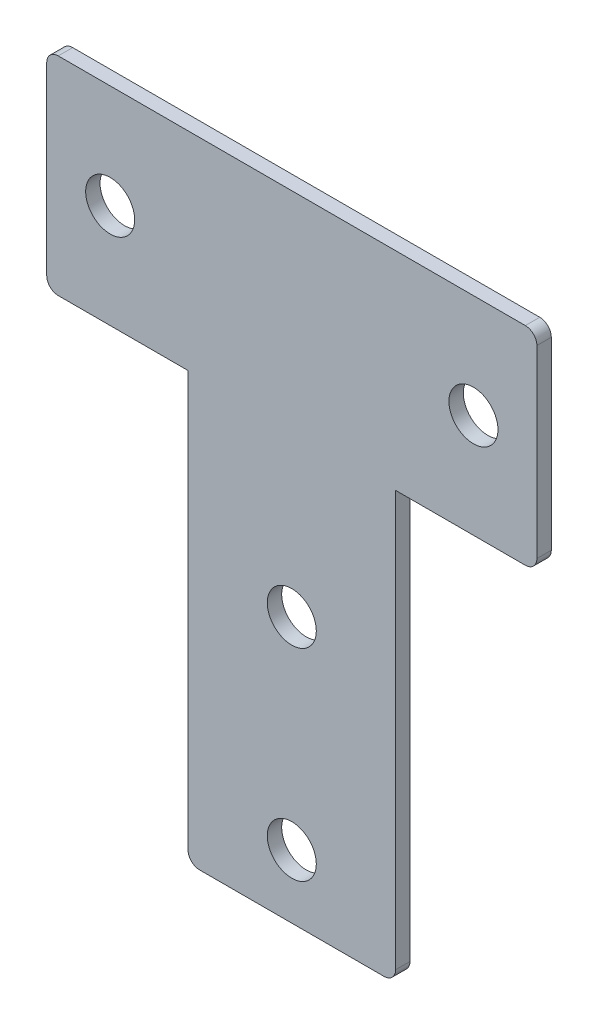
ISO-10303-21;
HEADER;
FILE_DESCRIPTION(('STEP AP214'),'2;1');
FILE_NAME('part.step','',(''),(''),'','','');
FILE_SCHEMA(('AUTOMOTIVE_DESIGN { 1 0 10303 214 1 1 1 1 }'));
ENDSEC;
DATA;
#1=APPLICATION_CONTEXT('core data for automotive mechanical design processes');
#2=APPLICATION_PROTOCOL_DEFINITION('international standard','automotive_design',2000,#1);
#3=PRODUCT_CONTEXT('',#1,'mechanical');
#4=PRODUCT('Part','Part','',(#3));
#5=PRODUCT_RELATED_PRODUCT_CATEGORY('part','',(#4));
#6=PRODUCT_DEFINITION_FORMATION('','',#4);
#7=PRODUCT_DEFINITION_CONTEXT('part definition',#1,'design');
#8=PRODUCT_DEFINITION('design','',#6,#7);
#9=PRODUCT_DEFINITION_SHAPE('','',#8);
#10=(LENGTH_UNIT() NAMED_UNIT(*) SI_UNIT(.MILLI.,.METRE.));
#11=(NAMED_UNIT(*) PLANE_ANGLE_UNIT() SI_UNIT($,.RADIAN.));
#12=(NAMED_UNIT(*) SI_UNIT($,.STERADIAN.) SOLID_ANGLE_UNIT());
#13=UNCERTAINTY_MEASURE_WITH_UNIT(LENGTH_MEASURE(1.E-05),#10,'distance_accuracy_value','');
#14=(GEOMETRIC_REPRESENTATION_CONTEXT(3) GLOBAL_UNCERTAINTY_ASSIGNED_CONTEXT((#13)) GLOBAL_UNIT_ASSIGNED_CONTEXT((#10,
#11,#12)) REPRESENTATION_CONTEXT('',''));
#15=CARTESIAN_POINT('',(0.,0.,0.));
#16=DIRECTION('',(0.,0.,1.));
#17=DIRECTION('',(1.,0.,0.));
#18=AXIS2_PLACEMENT_3D('',#15,#16,#17);
#19=CARTESIAN_POINT('',(0.,0.,1.25));
#20=DIRECTION('',(0.,0.,1.));
#21=DIRECTION('',(1.,0.,0.));
#22=AXIS2_PLACEMENT_3D('',#19,#20,#21);
#23=PLANE('',#22);
#24=DIRECTION('',(1.,0.,0.));
#25=VECTOR('',#24,1.);
#26=CARTESIAN_POINT('',(-18.,-92.,1.25));
#27=LINE('',#26,#25);
#28=CARTESIAN_POINT('',(-16.,-92.,1.25));
#29=VERTEX_POINT('',#28);
#30=CARTESIAN_POINT('',(16.,-92.,1.25));
#31=VERTEX_POINT('',#30);
#32=EDGE_CURVE('E163',#29,#31,#27,.T.);
#33=ORIENTED_EDGE('',*,*,#32,.T.);
#34=CARTESIAN_POINT('',(16.,-90.,1.25));
#35=DIRECTION('',(0.,0.,1.));
#36=DIRECTION('',(1.,0.,0.));
#37=AXIS2_PLACEMENT_3D('',#34,#35,#36);
#38=CIRCLE('',#37,2.);
#39=CARTESIAN_POINT('',(18.,-90.,1.25));
#40=VERTEX_POINT('',#39);
#41=EDGE_CURVE('E223',#31,#40,#38,.T.);
#42=ORIENTED_EDGE('',*,*,#41,.T.);
#43=DIRECTION('',(0.,1.,0.));
#44=VECTOR('',#43,1.);
#45=CARTESIAN_POINT('',(18.,-18.,1.25));
#46=LINE('',#45,#44);
#47=CARTESIAN_POINT('',(18.,-18.,1.25));
#48=VERTEX_POINT('',#47);
#49=EDGE_CURVE('E165',#40,#48,#46,.T.);
#50=ORIENTED_EDGE('',*,*,#49,.T.);
#51=DIRECTION('',(1.,0.,0.));
#52=VECTOR('',#51,1.);
#53=CARTESIAN_POINT('',(18.,-18.,1.25));
#54=LINE('',#53,#52);
#55=CARTESIAN_POINT('',(40.5,-18.,1.25));
#56=VERTEX_POINT('',#55);
#57=EDGE_CURVE('E170',#48,#56,#54,.T.);
#58=ORIENTED_EDGE('',*,*,#57,.T.);
#59=CARTESIAN_POINT('',(40.5,-16.,1.25));
#60=DIRECTION('',(0.,0.,1.));
#61=DIRECTION('',(1.,0.,0.));
#62=AXIS2_PLACEMENT_3D('',#59,#60,#61);
#63=CIRCLE('',#62,2.);
#64=CARTESIAN_POINT('',(42.5,-16.,1.25));
#65=VERTEX_POINT('',#64);
#66=EDGE_CURVE('E216',#56,#65,#63,.T.);
#67=ORIENTED_EDGE('',*,*,#66,.T.);
#68=DIRECTION('',(0.,1.,0.));
#69=VECTOR('',#68,1.);
#70=CARTESIAN_POINT('',(42.5,18.,1.25));
#71=LINE('',#70,#69);
#72=CARTESIAN_POINT('',(42.5,16.,1.25));
#73=VERTEX_POINT('',#72);
#74=EDGE_CURVE('E192',#65,#73,#71,.T.);
#75=ORIENTED_EDGE('',*,*,#74,.T.);
#76=CARTESIAN_POINT('',(40.5,16.,1.25));
#77=DIRECTION('',(0.,0.,1.));
#78=DIRECTION('',(1.,0.,0.));
#79=AXIS2_PLACEMENT_3D('',#76,#77,#78);
#80=CIRCLE('',#79,2.);
#81=CARTESIAN_POINT('',(40.5,18.,1.25));
#82=VERTEX_POINT('',#81);
#83=EDGE_CURVE('E214',#73,#82,#80,.T.);
#84=ORIENTED_EDGE('',*,*,#83,.T.);
#85=DIRECTION('',(-1.,0.,0.));
#86=VECTOR('',#85,1.);
#87=CARTESIAN_POINT('',(-42.5,18.,1.25));
#88=LINE('',#87,#86);
#89=CARTESIAN_POINT('',(-40.5,18.,1.25));
#90=VERTEX_POINT('',#89);
#91=EDGE_CURVE('E263',#82,#90,#88,.T.);
#92=ORIENTED_EDGE('',*,*,#91,.T.);
#93=CARTESIAN_POINT('',(-40.5,16.,1.25));
#94=DIRECTION('',(0.,0.,1.));
#95=DIRECTION('',(1.,0.,0.));
#96=AXIS2_PLACEMENT_3D('',#93,#94,#95);
#97=CIRCLE('',#96,2.);
#98=CARTESIAN_POINT('',(-42.5,16.,1.25));
#99=VERTEX_POINT('',#98);
#100=EDGE_CURVE('E218',#90,#99,#97,.T.);
#101=ORIENTED_EDGE('',*,*,#100,.T.);
#102=DIRECTION('',(0.,-1.,0.));
#103=VECTOR('',#102,1.);
#104=CARTESIAN_POINT('',(-42.5,18.,1.25));
#105=LINE('',#104,#103);
#106=CARTESIAN_POINT('',(-42.5,-16.,1.25));
#107=VERTEX_POINT('',#106);
#108=EDGE_CURVE('E151',#99,#107,#105,.T.);
#109=ORIENTED_EDGE('',*,*,#108,.T.);
#110=CARTESIAN_POINT('',(-40.5,-16.,1.25));
#111=DIRECTION('',(0.,0.,1.));
#112=DIRECTION('',(1.,0.,0.));
#113=AXIS2_PLACEMENT_3D('',#110,#111,#112);
#114=CIRCLE('',#113,2.);
#115=CARTESIAN_POINT('',(-40.5,-18.,1.25));
#116=VERTEX_POINT('',#115);
#117=EDGE_CURVE('E147',#107,#116,#114,.T.);
#118=ORIENTED_EDGE('',*,*,#117,.T.);
#119=DIRECTION('',(1.,0.,0.));
#120=VECTOR('',#119,1.);
#121=CARTESIAN_POINT('',(-42.5,-18.,1.25));
#122=LINE('',#121,#120);
#123=CARTESIAN_POINT('',(-18.,-18.,1.25));
#124=VERTEX_POINT('',#123);
#125=EDGE_CURVE('E139',#116,#124,#122,.T.);
#126=ORIENTED_EDGE('',*,*,#125,.T.);
#127=DIRECTION('',(0.,-1.,0.));
#128=VECTOR('',#127,1.);
#129=CARTESIAN_POINT('',(-18.,-18.,1.25));
#130=LINE('',#129,#128);
#131=CARTESIAN_POINT('',(-18.,-90.,1.25));
#132=VERTEX_POINT('',#131);
#133=EDGE_CURVE('E143',#124,#132,#130,.T.);
#134=ORIENTED_EDGE('',*,*,#133,.T.);
#135=CARTESIAN_POINT('',(-16.,-90.,1.25));
#136=DIRECTION('',(0.,0.,1.));
#137=DIRECTION('',(1.,0.,0.));
#138=AXIS2_PLACEMENT_3D('',#135,#136,#137);
#139=CIRCLE('',#138,2.);
#140=EDGE_CURVE('E221',#132,#29,#139,.T.);
#141=ORIENTED_EDGE('',*,*,#140,.T.);
#142=EDGE_LOOP('',(#33,#42,#50,#58,#67,#75,#84,#92,#101,#109,#118,#126,#134,#141));
#143=FACE_BOUND('',#142,.T.);
#144=CARTESIAN_POINT('',(31.5,0.,1.25));
#145=DIRECTION('',(0.,0.,1.));
#146=DIRECTION('',(1.,0.,0.));
#147=AXIS2_PLACEMENT_3D('',#144,#145,#146);
#148=CIRCLE('',#147,4.25000000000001);
#149=CARTESIAN_POINT('',(35.75,0.,1.25));
#150=VERTEX_POINT('',#149);
#151=EDGE_CURVE('E268',#150,#150,#148,.T.);
#152=ORIENTED_EDGE('',*,*,#151,.F.);
#153=EDGE_LOOP('',(#152));
#154=FACE_BOUND('',#153,.T.);
#155=CARTESIAN_POINT('',(0.,-81.,1.25));
#156=DIRECTION('',(0.,0.,1.));
#157=DIRECTION('',(1.,0.,0.));
#158=AXIS2_PLACEMENT_3D('',#155,#156,#157);
#159=CIRCLE('',#158,4.25);
#160=CARTESIAN_POINT('',(4.24999999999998,-81.,1.25));
#161=VERTEX_POINT('',#160);
#162=EDGE_CURVE('E274',#161,#161,#159,.T.);
#163=ORIENTED_EDGE('',*,*,#162,.F.);
#164=EDGE_LOOP('',(#163));
#165=FACE_BOUND('',#164,.T.);
#166=CARTESIAN_POINT('',(0.,-46.,1.25));
#167=DIRECTION('',(0.,0.,1.));
#168=DIRECTION('',(1.,0.,0.));
#169=AXIS2_PLACEMENT_3D('',#166,#167,#168);
#170=CIRCLE('',#169,4.25);
#171=CARTESIAN_POINT('',(4.24999999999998,-46.,1.25));
#172=VERTEX_POINT('',#171);
#173=EDGE_CURVE('E280',#172,#172,#170,.T.);
#174=ORIENTED_EDGE('',*,*,#173,.F.);
#175=EDGE_LOOP('',(#174));
#176=FACE_BOUND('',#175,.T.);
#177=CARTESIAN_POINT('',(-31.5,0.,1.25));
#178=DIRECTION('',(0.,0.,-1.));
#179=DIRECTION('',(-1.,0.,0.));
#180=AXIS2_PLACEMENT_3D('',#177,#178,#179);
#181=CIRCLE('',#180,4.25000000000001);
#182=CARTESIAN_POINT('',(-35.75,0.,1.25));
#183=VERTEX_POINT('',#182);
#184=EDGE_CURVE('E286',#183,#183,#181,.T.);
#185=ORIENTED_EDGE('',*,*,#184,.T.);
#186=EDGE_LOOP('',(#185));
#187=FACE_BOUND('',#186,.T.);
#188=ADVANCED_FACE('F37',(#143,#154,#165,#176,#187),#23,.T.);
#189=CARTESIAN_POINT('',(0.,0.,-1.25));
#190=DIRECTION('',(0.,0.,1.));
#191=DIRECTION('',(1.,0.,0.));
#192=AXIS2_PLACEMENT_3D('',#189,#190,#191);
#193=PLANE('',#192);
#194=DIRECTION('',(0.,1.,0.));
#195=VECTOR('',#194,1.);
#196=CARTESIAN_POINT('',(18.,-18.,-1.25));
#197=LINE('',#196,#195);
#198=CARTESIAN_POINT('',(18.,-90.,-1.25));
#199=VERTEX_POINT('',#198);
#200=CARTESIAN_POINT('',(18.,-18.,-1.25));
#201=VERTEX_POINT('',#200);
#202=EDGE_CURVE('E188',#199,#201,#197,.T.);
#203=ORIENTED_EDGE('',*,*,#202,.F.);
#204=CARTESIAN_POINT('',(16.,-90.,-1.25));
#205=DIRECTION('',(0.,0.,1.));
#206=DIRECTION('',(1.,0.,0.));
#207=AXIS2_PLACEMENT_3D('',#204,#205,#206);
#208=CIRCLE('',#207,2.);
#209=CARTESIAN_POINT('',(16.,-92.,-1.25));
#210=VERTEX_POINT('',#209);
#211=EDGE_CURVE('E207',#199,#210,#208,.F.);
#212=ORIENTED_EDGE('',*,*,#211,.T.);
#213=DIRECTION('',(1.,0.,0.));
#214=VECTOR('',#213,1.);
#215=CARTESIAN_POINT('',(-18.,-92.,-1.25));
#216=LINE('',#215,#214);
#217=CARTESIAN_POINT('',(-16.,-92.,-1.25));
#218=VERTEX_POINT('',#217);
#219=EDGE_CURVE('E185',#218,#210,#216,.T.);
#220=ORIENTED_EDGE('',*,*,#219,.F.);
#221=CARTESIAN_POINT('',(-16.,-90.,-1.25));
#222=DIRECTION('',(0.,0.,1.));
#223=DIRECTION('',(1.,0.,0.));
#224=AXIS2_PLACEMENT_3D('',#221,#222,#223);
#225=CIRCLE('',#224,2.);
#226=CARTESIAN_POINT('',(-18.,-90.,-1.25));
#227=VERTEX_POINT('',#226);
#228=EDGE_CURVE('E205',#218,#227,#225,.F.);
#229=ORIENTED_EDGE('',*,*,#228,.T.);
#230=DIRECTION('',(0.,-1.,0.));
#231=VECTOR('',#230,1.);
#232=CARTESIAN_POINT('',(-18.,-18.,-1.25));
#233=LINE('',#232,#231);
#234=CARTESIAN_POINT('',(-18.,-18.,-1.25));
#235=VERTEX_POINT('',#234);
#236=EDGE_CURVE('E183',#235,#227,#233,.T.);
#237=ORIENTED_EDGE('',*,*,#236,.F.);
#238=DIRECTION('',(1.,0.,0.));
#239=VECTOR('',#238,1.);
#240=CARTESIAN_POINT('',(-42.5,-18.,-1.25));
#241=LINE('',#240,#239);
#242=CARTESIAN_POINT('',(-40.5,-18.,-1.25));
#243=VERTEX_POINT('',#242);
#244=EDGE_CURVE('E157',#243,#235,#241,.T.);
#245=ORIENTED_EDGE('',*,*,#244,.F.);
#246=CARTESIAN_POINT('',(-40.5,-16.,-1.25));
#247=DIRECTION('',(0.,0.,1.));
#248=DIRECTION('',(1.,0.,0.));
#249=AXIS2_PLACEMENT_3D('',#246,#247,#248);
#250=CIRCLE('',#249,2.);
#251=CARTESIAN_POINT('',(-42.5,-16.,-1.25));
#252=VERTEX_POINT('',#251);
#253=EDGE_CURVE('E203',#243,#252,#250,.F.);
#254=ORIENTED_EDGE('',*,*,#253,.T.);
#255=DIRECTION('',(0.,-1.,0.));
#256=VECTOR('',#255,1.);
#257=CARTESIAN_POINT('',(-42.5,18.,-1.25));
#258=LINE('',#257,#256);
#259=CARTESIAN_POINT('',(-42.5,16.,-1.25));
#260=VERTEX_POINT('',#259);
#261=EDGE_CURVE('E179',#260,#252,#258,.T.);
#262=ORIENTED_EDGE('',*,*,#261,.F.);
#263=CARTESIAN_POINT('',(-40.5,16.,-1.25));
#264=DIRECTION('',(0.,0.,1.));
#265=DIRECTION('',(1.,0.,0.));
#266=AXIS2_PLACEMENT_3D('',#263,#264,#265);
#267=CIRCLE('',#266,2.);
#268=CARTESIAN_POINT('',(-40.5,18.,-1.25));
#269=VERTEX_POINT('',#268);
#270=EDGE_CURVE('E201',#260,#269,#267,.F.);
#271=ORIENTED_EDGE('',*,*,#270,.T.);
#272=DIRECTION('',(-1.,0.,0.));
#273=VECTOR('',#272,1.);
#274=CARTESIAN_POINT('',(-42.5,18.,-1.25));
#275=LINE('',#274,#273);
#276=CARTESIAN_POINT('',(40.5,18.,-1.25));
#277=VERTEX_POINT('',#276);
#278=EDGE_CURVE('E175',#277,#269,#275,.T.);
#279=ORIENTED_EDGE('',*,*,#278,.F.);
#280=CARTESIAN_POINT('',(40.5,16.,-1.25));
#281=DIRECTION('',(0.,0.,1.));
#282=DIRECTION('',(1.,0.,0.));
#283=AXIS2_PLACEMENT_3D('',#280,#281,#282);
#284=CIRCLE('',#283,2.);
#285=CARTESIAN_POINT('',(42.5,16.,-1.25));
#286=VERTEX_POINT('',#285);
#287=EDGE_CURVE('E197',#277,#286,#284,.F.);
#288=ORIENTED_EDGE('',*,*,#287,.T.);
#289=DIRECTION('',(0.,1.,0.));
#290=VECTOR('',#289,1.);
#291=CARTESIAN_POINT('',(42.5,18.,-1.25));
#292=LINE('',#291,#290);
#293=CARTESIAN_POINT('',(42.5,-16.,-1.25));
#294=VERTEX_POINT('',#293);
#295=EDGE_CURVE('E172',#294,#286,#292,.T.);
#296=ORIENTED_EDGE('',*,*,#295,.F.);
#297=CARTESIAN_POINT('',(40.5,-16.,-1.25));
#298=DIRECTION('',(0.,0.,1.));
#299=DIRECTION('',(1.,0.,0.));
#300=AXIS2_PLACEMENT_3D('',#297,#298,#299);
#301=CIRCLE('',#300,2.);
#302=CARTESIAN_POINT('',(40.5,-18.,-1.25));
#303=VERTEX_POINT('',#302);
#304=EDGE_CURVE('E199',#294,#303,#301,.F.);
#305=ORIENTED_EDGE('',*,*,#304,.T.);
#306=DIRECTION('',(1.,0.,0.));
#307=VECTOR('',#306,1.);
#308=CARTESIAN_POINT('',(18.,-18.,-1.25));
#309=LINE('',#308,#307);
#310=EDGE_CURVE('E190',#201,#303,#309,.T.);
#311=ORIENTED_EDGE('',*,*,#310,.F.);
#312=EDGE_LOOP('',(#203,#212,#220,#229,#237,#245,#254,#262,#271,#279,#288,#296,#305,#311));
#313=FACE_BOUND('',#312,.T.);
#314=CARTESIAN_POINT('',(31.5,0.,-1.25));
#315=DIRECTION('',(0.,0.,1.));
#316=DIRECTION('',(1.,0.,0.));
#317=AXIS2_PLACEMENT_3D('',#314,#315,#316);
#318=CIRCLE('',#317,4.25000000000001);
#319=CARTESIAN_POINT('',(35.75,0.,-1.25));
#320=VERTEX_POINT('',#319);
#321=EDGE_CURVE('E176',#320,#320,#318,.T.);
#322=ORIENTED_EDGE('',*,*,#321,.T.);
#323=EDGE_LOOP('',(#322));
#324=FACE_BOUND('',#323,.T.);
#325=CARTESIAN_POINT('',(0.,-81.,-1.25));
#326=DIRECTION('',(0.,0.,1.));
#327=DIRECTION('',(1.,0.,0.));
#328=AXIS2_PLACEMENT_3D('',#325,#326,#327);
#329=CIRCLE('',#328,4.25);
#330=CARTESIAN_POINT('',(4.24999999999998,-81.,-1.25));
#331=VERTEX_POINT('',#330);
#332=EDGE_CURVE('E271',#331,#331,#329,.T.);
#333=ORIENTED_EDGE('',*,*,#332,.T.);
#334=EDGE_LOOP('',(#333));
#335=FACE_BOUND('',#334,.T.);
#336=CARTESIAN_POINT('',(0.,-46.,-1.25));
#337=DIRECTION('',(0.,0.,1.));
#338=DIRECTION('',(1.,0.,0.));
#339=AXIS2_PLACEMENT_3D('',#336,#337,#338);
#340=CIRCLE('',#339,4.25);
#341=CARTESIAN_POINT('',(4.24999999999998,-46.,-1.25));
#342=VERTEX_POINT('',#341);
#343=EDGE_CURVE('E277',#342,#342,#340,.T.);
#344=ORIENTED_EDGE('',*,*,#343,.T.);
#345=EDGE_LOOP('',(#344));
#346=FACE_BOUND('',#345,.T.);
#347=CARTESIAN_POINT('',(-31.5,0.,-1.25));
#348=DIRECTION('',(0.,0.,-1.));
#349=DIRECTION('',(-1.,0.,0.));
#350=AXIS2_PLACEMENT_3D('',#347,#348,#349);
#351=CIRCLE('',#350,4.25000000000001);
#352=CARTESIAN_POINT('',(-35.75,0.,-1.25));
#353=VERTEX_POINT('',#352);
#354=EDGE_CURVE('E283',#353,#353,#351,.T.);
#355=ORIENTED_EDGE('',*,*,#354,.F.);
#356=EDGE_LOOP('',(#355));
#357=FACE_BOUND('',#356,.T.);
#358=ADVANCED_FACE('F251',(#313,#324,#335,#346,#357),#193,.F.);
#359=CARTESIAN_POINT('',(42.5,18.,1.25));
#360=DIRECTION('',(-1.,0.,0.));
#361=DIRECTION('',(0.,-1.,0.));
#362=AXIS2_PLACEMENT_3D('',#359,#360,#361);
#363=PLANE('',#362);
#364=ORIENTED_EDGE('',*,*,#74,.F.);
#365=DIRECTION('',(0.,0.,-1.));
#366=VECTOR('',#365,1.);
#367=CARTESIAN_POINT('',(42.5,-16.,1.25));
#368=LINE('',#367,#366);
#369=EDGE_CURVE('E45',#65,#294,#368,.T.);
#370=ORIENTED_EDGE('',*,*,#369,.T.);
#371=ORIENTED_EDGE('',*,*,#295,.T.);
#372=DIRECTION('',(0.,0.,-1.));
#373=VECTOR('',#372,1.);
#374=CARTESIAN_POINT('',(42.5,16.,1.25));
#375=LINE('',#374,#373);
#376=EDGE_CURVE('E238',#286,#73,#375,.F.);
#377=ORIENTED_EDGE('',*,*,#376,.T.);
#378=EDGE_LOOP('',(#364,#370,#371,#377));
#379=FACE_BOUND('',#378,.T.);
#380=ADVANCED_FACE('F244',(#379),#363,.F.);
#381=CARTESIAN_POINT('',(-42.5,18.,1.25));
#382=DIRECTION('',(0.,-1.,0.));
#383=DIRECTION('',(0.,0.,-1.));
#384=AXIS2_PLACEMENT_3D('',#381,#382,#383);
#385=PLANE('',#384);
#386=ORIENTED_EDGE('',*,*,#278,.T.);
#387=DIRECTION('',(0.,0.,-1.));
#388=VECTOR('',#387,1.);
#389=CARTESIAN_POINT('',(-40.5,18.,1.25));
#390=LINE('',#389,#388);
#391=EDGE_CURVE('E236',#269,#90,#390,.F.);
#392=ORIENTED_EDGE('',*,*,#391,.T.);
#393=ORIENTED_EDGE('',*,*,#91,.F.);
#394=DIRECTION('',(0.,0.,-1.));
#395=VECTOR('',#394,1.);
#396=CARTESIAN_POINT('',(40.5,18.,1.25));
#397=LINE('',#396,#395);
#398=EDGE_CURVE('E233',#82,#277,#397,.T.);
#399=ORIENTED_EDGE('',*,*,#398,.T.);
#400=EDGE_LOOP('',(#386,#392,#393,#399));
#401=FACE_BOUND('',#400,.T.);
#402=ADVANCED_FACE('F260',(#401),#385,.F.);
#403=CARTESIAN_POINT('',(-42.5,18.,1.25));
#404=DIRECTION('',(1.,0.,0.));
#405=DIRECTION('',(0.,1.,0.));
#406=AXIS2_PLACEMENT_3D('',#403,#404,#405);
#407=PLANE('',#406);
#408=ORIENTED_EDGE('',*,*,#261,.T.);
#409=DIRECTION('',(0.,0.,-1.));
#410=VECTOR('',#409,1.);
#411=CARTESIAN_POINT('',(-42.5,-16.,1.25));
#412=LINE('',#411,#410);
#413=EDGE_CURVE('E231',#252,#107,#412,.F.);
#414=ORIENTED_EDGE('',*,*,#413,.T.);
#415=ORIENTED_EDGE('',*,*,#108,.F.);
#416=DIRECTION('',(0.,0.,-1.));
#417=VECTOR('',#416,1.);
#418=CARTESIAN_POINT('',(-42.5,16.,1.25));
#419=LINE('',#418,#417);
#420=EDGE_CURVE('E228',#99,#260,#419,.T.);
#421=ORIENTED_EDGE('',*,*,#420,.T.);
#422=EDGE_LOOP('',(#408,#414,#415,#421));
#423=FACE_BOUND('',#422,.T.);
#424=ADVANCED_FACE('F321',(#423),#407,.F.);
#425=CARTESIAN_POINT('',(-42.5,-18.,1.25));
#426=DIRECTION('',(0.,1.,0.));
#427=DIRECTION('',(0.,0.,1.));
#428=AXIS2_PLACEMENT_3D('',#425,#426,#427);
#429=PLANE('',#428);
#430=ORIENTED_EDGE('',*,*,#125,.F.);
#431=DIRECTION('',(0.,0.,-1.));
#432=VECTOR('',#431,1.);
#433=CARTESIAN_POINT('',(-40.5,-18.,1.25));
#434=LINE('',#433,#432);
#435=EDGE_CURVE('E226',#116,#243,#434,.T.);
#436=ORIENTED_EDGE('',*,*,#435,.T.);
#437=ORIENTED_EDGE('',*,*,#244,.T.);
#438=DIRECTION('',(0.,0.,-1.));
#439=VECTOR('',#438,1.);
#440=CARTESIAN_POINT('',(-18.,-18.,1.25));
#441=LINE('',#440,#439);
#442=EDGE_CURVE('E154',#124,#235,#441,.T.);
#443=ORIENTED_EDGE('',*,*,#442,.F.);
#444=EDGE_LOOP('',(#430,#436,#437,#443));
#445=FACE_BOUND('',#444,.T.);
#446=ADVANCED_FACE('F155',(#445),#429,.F.);
#447=CARTESIAN_POINT('',(-18.,-18.,1.25));
#448=DIRECTION('',(1.,0.,0.));
#449=DIRECTION('',(0.,1.,0.));
#450=AXIS2_PLACEMENT_3D('',#447,#448,#449);
#451=PLANE('',#450);
#452=ORIENTED_EDGE('',*,*,#236,.T.);
#453=DIRECTION('',(0.,0.,-1.));
#454=VECTOR('',#453,1.);
#455=CARTESIAN_POINT('',(-18.,-90.,1.25));
#456=LINE('',#455,#454);
#457=EDGE_CURVE('E58',#227,#132,#456,.F.);
#458=ORIENTED_EDGE('',*,*,#457,.T.);
#459=ORIENTED_EDGE('',*,*,#133,.F.);
#460=ORIENTED_EDGE('',*,*,#442,.T.);
#461=EDGE_LOOP('',(#452,#458,#459,#460));
#462=FACE_BOUND('',#461,.T.);
#463=ADVANCED_FACE('F162',(#462),#451,.F.);
#464=CARTESIAN_POINT('',(-18.,-92.,1.25));
#465=DIRECTION('',(0.,1.,0.));
#466=DIRECTION('',(0.,0.,1.));
#467=AXIS2_PLACEMENT_3D('',#464,#465,#466);
#468=PLANE('',#467);
#469=ORIENTED_EDGE('',*,*,#219,.T.);
#470=DIRECTION('',(0.,0.,-1.));
#471=VECTOR('',#470,1.);
#472=CARTESIAN_POINT('',(16.,-92.,1.25));
#473=LINE('',#472,#471);
#474=EDGE_CURVE('E212',#210,#31,#473,.F.);
#475=ORIENTED_EDGE('',*,*,#474,.T.);
#476=ORIENTED_EDGE('',*,*,#32,.F.);
#477=DIRECTION('',(0.,0.,-1.));
#478=VECTOR('',#477,1.);
#479=CARTESIAN_POINT('',(-16.,-92.,1.25));
#480=LINE('',#479,#478);
#481=EDGE_CURVE('E209',#29,#218,#480,.T.);
#482=ORIENTED_EDGE('',*,*,#481,.T.);
#483=EDGE_LOOP('',(#469,#475,#476,#482));
#484=FACE_BOUND('',#483,.T.);
#485=ADVANCED_FACE('F312',(#484),#468,.F.);
#486=CARTESIAN_POINT('',(18.,-18.,1.25));
#487=DIRECTION('',(-1.,0.,0.));
#488=DIRECTION('',(0.,-1.,0.));
#489=AXIS2_PLACEMENT_3D('',#486,#487,#488);
#490=PLANE('',#489);
#491=ORIENTED_EDGE('',*,*,#49,.F.);
#492=DIRECTION('',(0.,0.,-1.));
#493=VECTOR('',#492,1.);
#494=CARTESIAN_POINT('',(18.,-90.,1.25));
#495=LINE('',#494,#493);
#496=EDGE_CURVE('E159',#40,#199,#495,.T.);
#497=ORIENTED_EDGE('',*,*,#496,.T.);
#498=ORIENTED_EDGE('',*,*,#202,.T.);
#499=DIRECTION('',(0.,0.,-1.));
#500=VECTOR('',#499,1.);
#501=CARTESIAN_POINT('',(18.,-18.,1.25));
#502=LINE('',#501,#500);
#503=EDGE_CURVE('E160',#48,#201,#502,.T.);
#504=ORIENTED_EDGE('',*,*,#503,.F.);
#505=EDGE_LOOP('',(#491,#497,#498,#504));
#506=FACE_BOUND('',#505,.T.);
#507=ADVANCED_FACE('F309',(#506),#490,.F.);
#508=CARTESIAN_POINT('',(18.,-18.,1.25));
#509=DIRECTION('',(0.,1.,0.));
#510=DIRECTION('',(0.,0.,1.));
#511=AXIS2_PLACEMENT_3D('',#508,#509,#510);
#512=PLANE('',#511);
#513=ORIENTED_EDGE('',*,*,#310,.T.);
#514=DIRECTION('',(0.,0.,-1.));
#515=VECTOR('',#514,1.);
#516=CARTESIAN_POINT('',(40.5,-18.,1.25));
#517=LINE('',#516,#515);
#518=EDGE_CURVE('E11',#303,#56,#517,.F.);
#519=ORIENTED_EDGE('',*,*,#518,.T.);
#520=ORIENTED_EDGE('',*,*,#57,.F.);
#521=ORIENTED_EDGE('',*,*,#503,.T.);
#522=EDGE_LOOP('',(#513,#519,#520,#521));
#523=FACE_BOUND('',#522,.T.);
#524=ADVANCED_FACE('F305',(#523),#512,.F.);
#525=CARTESIAN_POINT('',(31.5,0.,-1.25));
#526=DIRECTION('',(0.,0.,1.));
#527=DIRECTION('',(1.,0.,0.));
#528=AXIS2_PLACEMENT_3D('',#525,#526,#527);
#529=CYLINDRICAL_SURFACE('',#528,4.25000000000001);
#530=ORIENTED_EDGE('',*,*,#321,.F.);
#531=EDGE_LOOP('',(#530));
#532=FACE_BOUND('',#531,.T.);
#533=ORIENTED_EDGE('',*,*,#151,.T.);
#534=EDGE_LOOP('',(#533));
#535=FACE_BOUND('',#534,.T.);
#536=ADVANCED_FACE('F308',(#532,#535),#529,.F.);
#537=CARTESIAN_POINT('',(0.,-81.,-1.25));
#538=DIRECTION('',(0.,0.,1.));
#539=DIRECTION('',(1.,0.,0.));
#540=AXIS2_PLACEMENT_3D('',#537,#538,#539);
#541=CYLINDRICAL_SURFACE('',#540,4.25);
#542=ORIENTED_EDGE('',*,*,#332,.F.);
#543=EDGE_LOOP('',(#542));
#544=FACE_BOUND('',#543,.T.);
#545=ORIENTED_EDGE('',*,*,#162,.T.);
#546=EDGE_LOOP('',(#545));
#547=FACE_BOUND('',#546,.T.);
#548=ADVANCED_FACE('F467',(#544,#547),#541,.F.);
#549=CARTESIAN_POINT('',(0.,-46.,-1.25));
#550=DIRECTION('',(0.,0.,1.));
#551=DIRECTION('',(1.,0.,0.));
#552=AXIS2_PLACEMENT_3D('',#549,#550,#551);
#553=CYLINDRICAL_SURFACE('',#552,4.25);
#554=ORIENTED_EDGE('',*,*,#343,.F.);
#555=EDGE_LOOP('',(#554));
#556=FACE_BOUND('',#555,.T.);
#557=ORIENTED_EDGE('',*,*,#173,.T.);
#558=EDGE_LOOP('',(#557));
#559=FACE_BOUND('',#558,.T.);
#560=ADVANCED_FACE('F459',(#556,#559),#553,.F.);
#561=CARTESIAN_POINT('',(-31.5,0.,-1.25));
#562=DIRECTION('',(0.,0.,1.));
#563=DIRECTION('',(1.,0.,0.));
#564=AXIS2_PLACEMENT_3D('',#561,#562,#563);
#565=CYLINDRICAL_SURFACE('',#564,4.25000000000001);
#566=ORIENTED_EDGE('',*,*,#354,.T.);
#567=EDGE_LOOP('',(#566));
#568=FACE_BOUND('',#567,.T.);
#569=ORIENTED_EDGE('',*,*,#184,.F.);
#570=EDGE_LOOP('',(#569));
#571=FACE_BOUND('',#570,.T.);
#572=ADVANCED_FACE('F292',(#568,#571),#565,.F.);
#573=CARTESIAN_POINT('',(16.,-90.,1.25));
#574=DIRECTION('',(0.,0.,-1.));
#575=DIRECTION('',(-1.,0.,0.));
#576=AXIS2_PLACEMENT_3D('',#573,#574,#575);
#577=CYLINDRICAL_SURFACE('',#576,2.);
#578=ORIENTED_EDGE('',*,*,#41,.F.);
#579=ORIENTED_EDGE('',*,*,#474,.F.);
#580=ORIENTED_EDGE('',*,*,#211,.F.);
#581=ORIENTED_EDGE('',*,*,#496,.F.);
#582=EDGE_LOOP('',(#578,#579,#580,#581));
#583=FACE_BOUND('',#582,.T.);
#584=ADVANCED_FACE('F327',(#583),#577,.T.);
#585=CARTESIAN_POINT('',(-16.,-90.,1.25));
#586=DIRECTION('',(0.,0.,-1.));
#587=DIRECTION('',(-1.,0.,0.));
#588=AXIS2_PLACEMENT_3D('',#585,#586,#587);
#589=CYLINDRICAL_SURFACE('',#588,2.);
#590=ORIENTED_EDGE('',*,*,#140,.F.);
#591=ORIENTED_EDGE('',*,*,#457,.F.);
#592=ORIENTED_EDGE('',*,*,#228,.F.);
#593=ORIENTED_EDGE('',*,*,#481,.F.);
#594=EDGE_LOOP('',(#590,#591,#592,#593));
#595=FACE_BOUND('',#594,.T.);
#596=ADVANCED_FACE('F330',(#595),#589,.T.);
#597=CARTESIAN_POINT('',(-40.5,-16.,1.25));
#598=DIRECTION('',(0.,0.,-1.));
#599=DIRECTION('',(-1.,0.,0.));
#600=AXIS2_PLACEMENT_3D('',#597,#598,#599);
#601=CYLINDRICAL_SURFACE('',#600,2.);
#602=ORIENTED_EDGE('',*,*,#117,.F.);
#603=ORIENTED_EDGE('',*,*,#413,.F.);
#604=ORIENTED_EDGE('',*,*,#253,.F.);
#605=ORIENTED_EDGE('',*,*,#435,.F.);
#606=EDGE_LOOP('',(#602,#603,#604,#605));
#607=FACE_BOUND('',#606,.T.);
#608=ADVANCED_FACE('F334',(#607),#601,.T.);
#609=CARTESIAN_POINT('',(-40.5,16.,1.25));
#610=DIRECTION('',(0.,0.,-1.));
#611=DIRECTION('',(-1.,0.,0.));
#612=AXIS2_PLACEMENT_3D('',#609,#610,#611);
#613=CYLINDRICAL_SURFACE('',#612,2.);
#614=ORIENTED_EDGE('',*,*,#100,.F.);
#615=ORIENTED_EDGE('',*,*,#391,.F.);
#616=ORIENTED_EDGE('',*,*,#270,.F.);
#617=ORIENTED_EDGE('',*,*,#420,.F.);
#618=EDGE_LOOP('',(#614,#615,#616,#617));
#619=FACE_BOUND('',#618,.T.);
#620=ADVANCED_FACE('F338',(#619),#613,.T.);
#621=CARTESIAN_POINT('',(40.5,-16.,1.25));
#622=DIRECTION('',(0.,0.,-1.));
#623=DIRECTION('',(-1.,0.,0.));
#624=AXIS2_PLACEMENT_3D('',#621,#622,#623);
#625=CYLINDRICAL_SURFACE('',#624,2.);
#626=ORIENTED_EDGE('',*,*,#66,.F.);
#627=ORIENTED_EDGE('',*,*,#518,.F.);
#628=ORIENTED_EDGE('',*,*,#304,.F.);
#629=ORIENTED_EDGE('',*,*,#369,.F.);
#630=EDGE_LOOP('',(#626,#627,#628,#629));
#631=FACE_BOUND('',#630,.T.);
#632=ADVANCED_FACE('F341',(#631),#625,.T.);
#633=CARTESIAN_POINT('',(40.5,16.,1.25));
#634=DIRECTION('',(0.,0.,-1.));
#635=DIRECTION('',(-1.,0.,0.));
#636=AXIS2_PLACEMENT_3D('',#633,#634,#635);
#637=CYLINDRICAL_SURFACE('',#636,2.);
#638=ORIENTED_EDGE('',*,*,#83,.F.);
#639=ORIENTED_EDGE('',*,*,#376,.F.);
#640=ORIENTED_EDGE('',*,*,#287,.F.);
#641=ORIENTED_EDGE('',*,*,#398,.F.);
#642=EDGE_LOOP('',(#638,#639,#640,#641));
#643=FACE_BOUND('',#642,.T.);
#644=ADVANCED_FACE('F39',(#643),#637,.T.);
#645=CLOSED_SHELL('',(#188,#358,#380,#402,#424,#446,#463,#485,#507,#524,#536,#548,#560,#572,
#584,#596,#608,#620,#632,#644));
#646=MANIFOLD_SOLID_BREP('B2',#645);
#647=ADVANCED_BREP_SHAPE_REPRESENTATION('',(#18,#646),#14);
#648=SHAPE_DEFINITION_REPRESENTATION(#9,#647);
ENDSEC;
END-ISO-10303-21;
